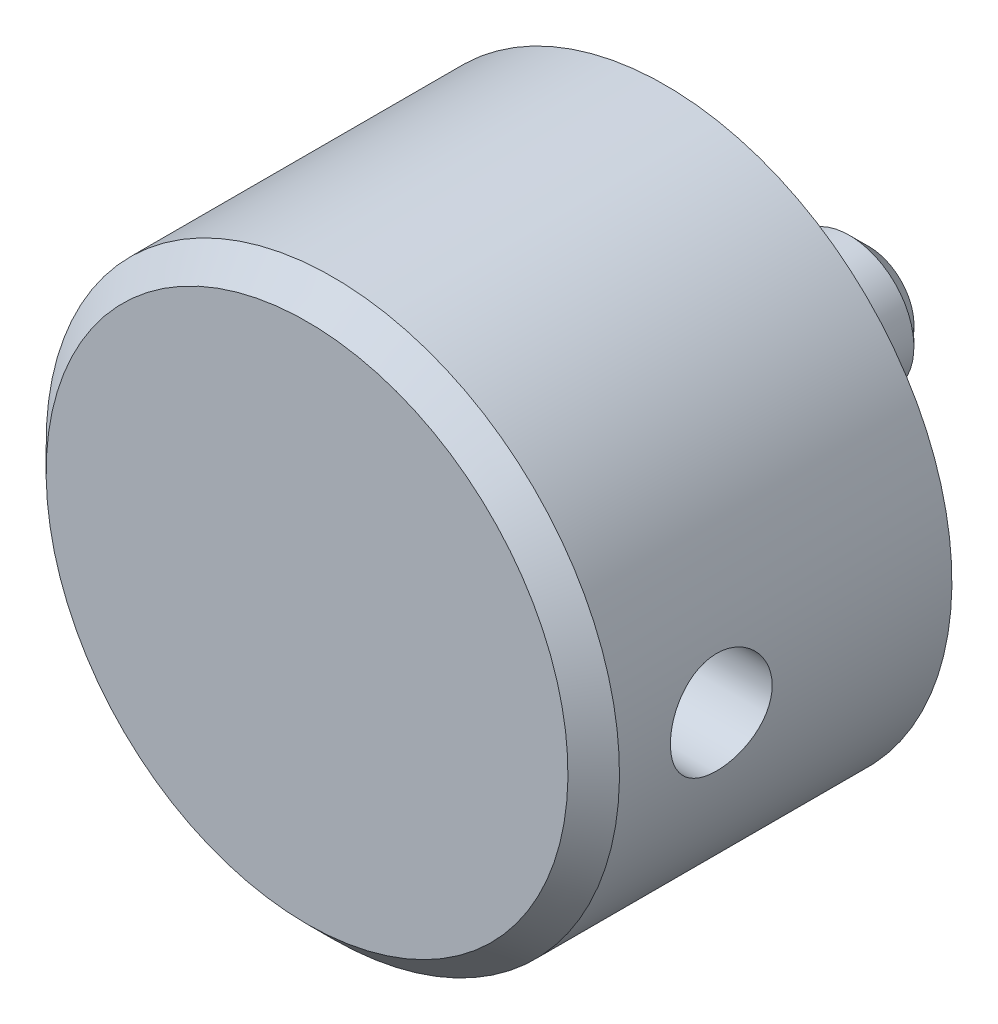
ISO-10303-21;
HEADER;
FILE_DESCRIPTION(('STEP AP214'),'2;1');
FILE_NAME('part.step','',(''),(''),'','','');
FILE_SCHEMA(('AUTOMOTIVE_DESIGN { 1 0 10303 214 1 1 1 1 }'));
ENDSEC;
DATA;
#1=APPLICATION_CONTEXT('core data for automotive mechanical design processes');
#2=APPLICATION_PROTOCOL_DEFINITION('international standard','automotive_design',2000,#1);
#3=PRODUCT_CONTEXT('',#1,'mechanical');
#4=PRODUCT('Part','Part','',(#3));
#5=PRODUCT_RELATED_PRODUCT_CATEGORY('part','',(#4));
#6=PRODUCT_DEFINITION_FORMATION('','',#4);
#7=PRODUCT_DEFINITION_CONTEXT('part definition',#1,'design');
#8=PRODUCT_DEFINITION('design','',#6,#7);
#9=PRODUCT_DEFINITION_SHAPE('','',#8);
#10=(LENGTH_UNIT() NAMED_UNIT(*) SI_UNIT(.MILLI.,.METRE.));
#11=(NAMED_UNIT(*) PLANE_ANGLE_UNIT() SI_UNIT($,.RADIAN.));
#12=(NAMED_UNIT(*) SI_UNIT($,.STERADIAN.) SOLID_ANGLE_UNIT());
#13=UNCERTAINTY_MEASURE_WITH_UNIT(LENGTH_MEASURE(1.E-05),#10,'distance_accuracy_value','');
#14=(GEOMETRIC_REPRESENTATION_CONTEXT(3) GLOBAL_UNCERTAINTY_ASSIGNED_CONTEXT((#13)) GLOBAL_UNIT_ASSIGNED_CONTEXT((#10,
#11,#12)) REPRESENTATION_CONTEXT('',''));
#15=CARTESIAN_POINT('',(0.,0.,0.));
#16=DIRECTION('',(0.,0.,1.));
#17=DIRECTION('',(1.,0.,0.));
#18=AXIS2_PLACEMENT_3D('',#15,#16,#17);
#19=CARTESIAN_POINT('',(0.,0.,29.));
#20=DIRECTION('',(0.,0.,1.));
#21=DIRECTION('',(0.,-1.,0.));
#22=AXIS2_PLACEMENT_3D('',#19,#20,#21);
#23=PLANE('',#22);
#24=CARTESIAN_POINT('',(0.,0.,29.));
#25=DIRECTION('',(0.,0.,1.));
#26=DIRECTION('',(0.,-1.,0.));
#27=AXIS2_PLACEMENT_3D('',#24,#25,#26);
#28=CIRCLE('',#27,20.25);
#29=CARTESIAN_POINT('',(0.,-20.25,29.));
#30=VERTEX_POINT('',#29);
#31=EDGE_CURVE('E86',#30,#30,#28,.T.);
#32=ORIENTED_EDGE('',*,*,#31,.T.);
#33=EDGE_LOOP('',(#32));
#34=FACE_BOUND('',#33,.T.);
#35=ADVANCED_FACE('F12',(#34),#23,.T.);
#36=CARTESIAN_POINT('',(0.,0.,39.1));
#37=DIRECTION('',(0.,0.,1.));
#38=DIRECTION('',(0.,-1.,0.));
#39=AXIS2_PLACEMENT_3D('',#36,#37,#38);
#40=CYLINDRICAL_SURFACE('',#39,22.25);
#41=CARTESIAN_POINT('',(0.,0.,27.));
#42=DIRECTION('',(0.,0.,1.));
#43=DIRECTION('',(0.,-1.,0.));
#44=AXIS2_PLACEMENT_3D('',#41,#42,#43);
#45=CIRCLE('',#44,22.25);
#46=CARTESIAN_POINT('',(0.,-22.25,27.));
#47=VERTEX_POINT('',#46);
#48=EDGE_CURVE('E87',#47,#47,#45,.F.);
#49=ORIENTED_EDGE('',*,*,#48,.T.);
#50=EDGE_LOOP('',(#49));
#51=FACE_BOUND('',#50,.T.);
#52=CARTESIAN_POINT('',(-22.25,0.,15.15));
#53=CARTESIAN_POINT('',(-22.2499961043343,-0.220020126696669,15.1500086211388));
#54=CARTESIAN_POINT('',(-22.2467026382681,-0.440154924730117,15.16844522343));
#55=CARTESIAN_POINT('',(-22.2338816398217,-0.874235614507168,15.2416653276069));
#56=CARTESIAN_POINT('',(-22.2243486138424,-1.08817587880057,15.2964808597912));
#57=CARTESIAN_POINT('',(-22.2001162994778,-1.50352571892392,15.4407393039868));
#58=CARTESIAN_POINT('',(-22.185421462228,-1.70494591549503,15.5301523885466));
#59=CARTESIAN_POINT('',(-22.1524756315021,-2.08990339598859,15.7409863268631));
#60=CARTESIAN_POINT('',(-22.1342249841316,-2.27344241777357,15.8624040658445));
#61=CARTESIAN_POINT('',(-22.095966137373,-2.61942964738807,16.1351925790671));
#62=CARTESIAN_POINT('',(-22.075942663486,-2.7816569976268,16.2868413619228));
#63=CARTESIAN_POINT('',(-22.0365100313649,-3.07850659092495,16.6151889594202));
#64=CARTESIAN_POINT('',(-22.0171009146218,-3.21312697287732,16.7918894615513));
#65=CARTESIAN_POINT('',(-21.9809464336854,-3.45184347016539,17.1668641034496));
#66=CARTESIAN_POINT('',(-21.964220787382,-3.55571798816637,17.3652813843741));
#67=CARTESIAN_POINT('',(-21.9355406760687,-3.72857631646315,17.7770959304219));
#68=CARTESIAN_POINT('',(-21.9235858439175,-3.79756281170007,17.9904920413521));
#69=CARTESIAN_POINT('',(-21.905953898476,-3.89798432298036,18.4238540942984));
#70=CARTESIAN_POINT('',(-21.9002127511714,-3.92980264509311,18.6437285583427));
#71=CARTESIAN_POINT('',(-21.8954648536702,-3.95617372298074,19.0857645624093));
#72=CARTESIAN_POINT('',(-21.8964575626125,-3.95072947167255,19.3079259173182));
#73=CARTESIAN_POINT('',(-21.9050068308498,-3.90304144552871,19.7454725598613));
#74=CARTESIAN_POINT('',(-21.9124861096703,-3.86123091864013,19.9609067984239));
#75=CARTESIAN_POINT('',(-21.9330446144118,-3.7426783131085,20.3816534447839));
#76=CARTESIAN_POINT('',(-21.9461240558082,-3.66593489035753,20.5869654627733));
#77=CARTESIAN_POINT('',(-21.9764912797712,-3.47926362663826,20.9829217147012));
#78=CARTESIAN_POINT('',(-21.9938014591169,-3.36915840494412,21.1734805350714));
#79=CARTESIAN_POINT('',(-22.0306645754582,-3.11901471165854,21.5335816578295));
#80=CARTESIAN_POINT('',(-22.0502177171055,-2.97897350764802,21.7031220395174));
#81=CARTESIAN_POINT('',(-22.0897017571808,-2.67058505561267,22.0188791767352));
#82=CARTESIAN_POINT('',(-22.1096340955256,-2.50186666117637,22.1647335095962));
#83=CARTESIAN_POINT('',(-22.1473766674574,-2.14216158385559,22.4261194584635));
#84=CARTESIAN_POINT('',(-22.1651868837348,-1.95117471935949,22.5416508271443));
#85=CARTESIAN_POINT('',(-22.1967089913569,-1.55199446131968,22.7391546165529));
#86=CARTESIAN_POINT('',(-22.2104166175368,-1.34378344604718,22.821092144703));
#87=CARTESIAN_POINT('',(-22.2321555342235,-0.916256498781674,22.9487308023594));
#88=CARTESIAN_POINT('',(-22.240187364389,-0.696941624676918,22.9944353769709));
#89=CARTESIAN_POINT('',(-22.2495963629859,-0.256553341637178,23.047812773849));
#90=CARTESIAN_POINT('',(-22.2510604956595,-0.0355419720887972,23.0559826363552));
#91=CARTESIAN_POINT('',(-22.2474083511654,0.404690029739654,23.0353879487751));
#92=CARTESIAN_POINT('',(-22.2422923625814,0.623910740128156,23.0066250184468));
#93=CARTESIAN_POINT('',(-22.226108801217,1.05278233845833,22.9133945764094));
#94=CARTESIAN_POINT('',(-22.2150827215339,1.26248902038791,22.8491758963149));
#95=CARTESIAN_POINT('',(-22.1883101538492,1.66815957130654,22.6871241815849));
#96=CARTESIAN_POINT('',(-22.1725633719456,1.86412258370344,22.5892890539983));
#97=CARTESIAN_POINT('',(-22.1378795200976,2.23888302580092,22.3616627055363));
#98=CARTESIAN_POINT('',(-22.1189123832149,2.41749111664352,22.2315644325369));
#99=CARTESIAN_POINT('',(-22.0799753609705,2.7505183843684,21.9435236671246));
#100=CARTESIAN_POINT('',(-22.0600053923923,2.90493554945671,21.7855788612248));
#101=CARTESIAN_POINT('',(-22.0210285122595,3.18706362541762,21.4440883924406));
#102=CARTESIAN_POINT('',(-22.0020357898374,3.31443696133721,21.260261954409));
#103=CARTESIAN_POINT('',(-21.9674390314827,3.53649611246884,20.8735296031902));
#104=CARTESIAN_POINT('',(-21.9518348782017,3.63118305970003,20.6706243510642));
#105=CARTESIAN_POINT('',(-21.9258909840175,3.78468997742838,20.2523938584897));
#106=CARTESIAN_POINT('',(-21.9155276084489,3.84367121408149,20.0371293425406));
#107=CARTESIAN_POINT('',(-21.9011819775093,3.924595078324,19.5995469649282));
#108=CARTESIAN_POINT('',(-21.8971990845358,3.94654140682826,19.3772298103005));
#109=CARTESIAN_POINT('',(-21.8960953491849,3.95265873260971,18.9352289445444));
#110=CARTESIAN_POINT('',(-21.8988778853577,3.9373616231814,18.715552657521));
#111=CARTESIAN_POINT('',(-21.9107784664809,3.87058371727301,18.2819542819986));
#112=CARTESIAN_POINT('',(-21.9198964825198,3.8191030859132,18.0680321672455));
#113=CARTESIAN_POINT('',(-21.943401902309,3.68163387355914,17.6522611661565));
#114=CARTESIAN_POINT('',(-21.9577813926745,3.59569709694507,17.4503946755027));
#115=CARTESIAN_POINT('',(-21.9901961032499,3.391811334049,17.0638590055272));
#116=CARTESIAN_POINT('',(-22.008231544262,3.27386041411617,16.8791908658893));
#117=CARTESIAN_POINT('',(-22.0462291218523,3.00742108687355,16.5296181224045));
#118=CARTESIAN_POINT('',(-22.0662139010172,2.85854345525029,16.3650125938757));
#119=CARTESIAN_POINT('',(-22.1056835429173,2.53529341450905,16.0629406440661));
#120=CARTESIAN_POINT('',(-22.1251682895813,2.36091514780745,15.9254804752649));
#121=CARTESIAN_POINT('',(-22.1616231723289,1.98995874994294,15.6805905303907));
#122=CARTESIAN_POINT('',(-22.1785720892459,1.79321517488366,15.5734081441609));
#123=CARTESIAN_POINT('',(-22.2078390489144,1.38428488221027,15.3937851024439));
#124=CARTESIAN_POINT('',(-22.2201615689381,1.1721133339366,15.321310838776));
#125=CARTESIAN_POINT('',(-22.2361874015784,0.799346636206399,15.2283799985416));
#126=CARTESIAN_POINT('',(-22.2413386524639,0.640969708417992,15.1990361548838));
#127=CARTESIAN_POINT('',(-22.2482463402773,0.321748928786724,15.1598432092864));
#128=CARTESIAN_POINT('',(-22.2500028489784,0.160905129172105,15.1499936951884));
#129=CARTESIAN_POINT('',(-22.25,0.,15.15));
#130=B_SPLINE_CURVE_WITH_KNOTS('',3,(#52,#53,#54,#55,#56,#57,#58,#59,#60,#61,#62,#63,#64,#65,
#66,#67,#68,#69,#70,#71,#72,#73,#74,#75,#76,#77,#78,#79,#80,#81,#82,#83,#84,#85,#86,#87,#88,#89,
#90,#91,#92,#93,#94,#95,#96,#97,#98,#99,#100,#101,#102,#103,#104,#105,#106,#107,#108,#109,#110,
#111,#112,#113,#114,#115,#116,#117,#118,#119,#120,#121,#122,#123,#124,#125,#126,#127,#128,#129),
.UNSPECIFIED.,.T.,.F.,(4,2,2,2,2,2,2,2,2,2,2,2,2,2,2,2,2,2,2,2,2,2,2,2,2,2,2,2,2,2,2,2,2,2,2,2,
2,2,4),(0.,0.659472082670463,1.31952557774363,1.9790112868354,2.63843283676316,3.30422421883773,
3.97006047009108,4.64058491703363,5.31105775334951,5.97455336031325,6.63799567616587,
7.29364071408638,7.94931098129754,8.6085304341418,9.26781008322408,9.93638213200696,
10.6049596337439,11.2742298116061,11.9434363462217,12.6037551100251,13.2640449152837,
13.9197585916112,14.5755130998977,15.2377655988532,15.9000731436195,16.5702164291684,
17.2403365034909,17.9074069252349,18.5744106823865,19.2319446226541,19.8894755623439,
20.5460215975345,21.2026072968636,21.8680200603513,22.5335859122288,23.2044421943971,
23.8746475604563,24.3569429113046,24.839228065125),.UNSPECIFIED.);
#131=CARTESIAN_POINT('',(-22.25,0.,15.15));
#132=VERTEX_POINT('',#131);
#133=EDGE_CURVE('E24',#132,#132,#130,.T.);
#134=ORIENTED_EDGE('',*,*,#133,.F.);
#135=EDGE_LOOP('',(#134));
#136=FACE_BOUND('',#135,.T.);
#137=CARTESIAN_POINT('',(22.25,0.,15.15));
#138=CARTESIAN_POINT('',(22.2499961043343,0.220020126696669,15.1500086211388));
#139=CARTESIAN_POINT('',(22.2467026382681,0.440154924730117,15.16844522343));
#140=CARTESIAN_POINT('',(22.2338816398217,0.874235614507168,15.2416653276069));
#141=CARTESIAN_POINT('',(22.2243486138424,1.08817587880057,15.2964808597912));
#142=CARTESIAN_POINT('',(22.2001162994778,1.50352571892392,15.4407393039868));
#143=CARTESIAN_POINT('',(22.185421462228,1.70494591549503,15.5301523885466));
#144=CARTESIAN_POINT('',(22.1524756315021,2.08990339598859,15.7409863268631));
#145=CARTESIAN_POINT('',(22.1342249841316,2.27344241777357,15.8624040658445));
#146=CARTESIAN_POINT('',(22.095966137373,2.61942964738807,16.1351925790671));
#147=CARTESIAN_POINT('',(22.075942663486,2.7816569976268,16.2868413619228));
#148=CARTESIAN_POINT('',(22.0365100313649,3.07850659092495,16.6151889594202));
#149=CARTESIAN_POINT('',(22.0171009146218,3.21312697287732,16.7918894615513));
#150=CARTESIAN_POINT('',(21.9809464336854,3.45184347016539,17.1668641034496));
#151=CARTESIAN_POINT('',(21.964220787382,3.55571798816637,17.3652813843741));
#152=CARTESIAN_POINT('',(21.9355406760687,3.72857631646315,17.7770959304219));
#153=CARTESIAN_POINT('',(21.9235858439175,3.79756281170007,17.9904920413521));
#154=CARTESIAN_POINT('',(21.905953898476,3.89798432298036,18.4238540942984));
#155=CARTESIAN_POINT('',(21.9002127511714,3.92980264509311,18.6437285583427));
#156=CARTESIAN_POINT('',(21.8954648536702,3.95617372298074,19.0857645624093));
#157=CARTESIAN_POINT('',(21.8964575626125,3.95072947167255,19.3079259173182));
#158=CARTESIAN_POINT('',(21.9050068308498,3.90304144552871,19.7454725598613));
#159=CARTESIAN_POINT('',(21.9124861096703,3.86123091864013,19.9609067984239));
#160=CARTESIAN_POINT('',(21.9330446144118,3.7426783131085,20.3816534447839));
#161=CARTESIAN_POINT('',(21.9461240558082,3.66593489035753,20.5869654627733));
#162=CARTESIAN_POINT('',(21.9764912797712,3.47926362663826,20.9829217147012));
#163=CARTESIAN_POINT('',(21.9938014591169,3.36915840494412,21.1734805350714));
#164=CARTESIAN_POINT('',(22.0306645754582,3.11901471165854,21.5335816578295));
#165=CARTESIAN_POINT('',(22.0502177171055,2.97897350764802,21.7031220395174));
#166=CARTESIAN_POINT('',(22.0897017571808,2.67058505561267,22.0188791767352));
#167=CARTESIAN_POINT('',(22.1096340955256,2.50186666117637,22.1647335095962));
#168=CARTESIAN_POINT('',(22.1473766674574,2.14216158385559,22.4261194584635));
#169=CARTESIAN_POINT('',(22.1651868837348,1.95117471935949,22.5416508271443));
#170=CARTESIAN_POINT('',(22.1967089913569,1.55199446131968,22.7391546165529));
#171=CARTESIAN_POINT('',(22.2104166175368,1.34378344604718,22.821092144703));
#172=CARTESIAN_POINT('',(22.2321555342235,0.916256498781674,22.9487308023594));
#173=CARTESIAN_POINT('',(22.240187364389,0.696941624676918,22.9944353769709));
#174=CARTESIAN_POINT('',(22.2495963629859,0.256553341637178,23.047812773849));
#175=CARTESIAN_POINT('',(22.2510604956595,0.0355419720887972,23.0559826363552));
#176=CARTESIAN_POINT('',(22.2474083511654,-0.404690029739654,23.0353879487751));
#177=CARTESIAN_POINT('',(22.2422923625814,-0.623910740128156,23.0066250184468));
#178=CARTESIAN_POINT('',(22.226108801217,-1.05278233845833,22.9133945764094));
#179=CARTESIAN_POINT('',(22.2150827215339,-1.26248902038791,22.8491758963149));
#180=CARTESIAN_POINT('',(22.1883101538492,-1.66815957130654,22.6871241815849));
#181=CARTESIAN_POINT('',(22.1725633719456,-1.86412258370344,22.5892890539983));
#182=CARTESIAN_POINT('',(22.1378795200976,-2.23888302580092,22.3616627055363));
#183=CARTESIAN_POINT('',(22.1189123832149,-2.41749111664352,22.2315644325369));
#184=CARTESIAN_POINT('',(22.0799753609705,-2.7505183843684,21.9435236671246));
#185=CARTESIAN_POINT('',(22.0600053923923,-2.90493554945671,21.7855788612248));
#186=CARTESIAN_POINT('',(22.0210285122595,-3.18706362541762,21.4440883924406));
#187=CARTESIAN_POINT('',(22.0020357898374,-3.31443696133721,21.260261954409));
#188=CARTESIAN_POINT('',(21.9674390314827,-3.53649611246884,20.8735296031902));
#189=CARTESIAN_POINT('',(21.9518348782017,-3.63118305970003,20.6706243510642));
#190=CARTESIAN_POINT('',(21.9258909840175,-3.78468997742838,20.2523938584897));
#191=CARTESIAN_POINT('',(21.9155276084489,-3.84367121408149,20.0371293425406));
#192=CARTESIAN_POINT('',(21.9011819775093,-3.924595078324,19.5995469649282));
#193=CARTESIAN_POINT('',(21.8971990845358,-3.94654140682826,19.3772298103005));
#194=CARTESIAN_POINT('',(21.8960953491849,-3.95265873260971,18.9352289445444));
#195=CARTESIAN_POINT('',(21.8988778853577,-3.9373616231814,18.715552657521));
#196=CARTESIAN_POINT('',(21.9107784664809,-3.87058371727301,18.2819542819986));
#197=CARTESIAN_POINT('',(21.9198964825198,-3.8191030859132,18.0680321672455));
#198=CARTESIAN_POINT('',(21.943401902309,-3.68163387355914,17.6522611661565));
#199=CARTESIAN_POINT('',(21.9577813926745,-3.59569709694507,17.4503946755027));
#200=CARTESIAN_POINT('',(21.9901961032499,-3.391811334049,17.0638590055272));
#201=CARTESIAN_POINT('',(22.008231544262,-3.27386041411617,16.8791908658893));
#202=CARTESIAN_POINT('',(22.0462291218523,-3.00742108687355,16.5296181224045));
#203=CARTESIAN_POINT('',(22.0662139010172,-2.85854345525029,16.3650125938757));
#204=CARTESIAN_POINT('',(22.1056835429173,-2.53529341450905,16.0629406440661));
#205=CARTESIAN_POINT('',(22.1251682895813,-2.36091514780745,15.9254804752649));
#206=CARTESIAN_POINT('',(22.1616231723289,-1.98995874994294,15.6805905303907));
#207=CARTESIAN_POINT('',(22.1785720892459,-1.79321517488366,15.5734081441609));
#208=CARTESIAN_POINT('',(22.2078390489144,-1.38428488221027,15.3937851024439));
#209=CARTESIAN_POINT('',(22.2201615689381,-1.1721133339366,15.321310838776));
#210=CARTESIAN_POINT('',(22.2361874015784,-0.799346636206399,15.2283799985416));
#211=CARTESIAN_POINT('',(22.2413386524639,-0.640969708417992,15.1990361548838));
#212=CARTESIAN_POINT('',(22.2482463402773,-0.321748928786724,15.1598432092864));
#213=CARTESIAN_POINT('',(22.2500028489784,-0.160905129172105,15.1499936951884));
#214=CARTESIAN_POINT('',(22.25,0.,15.15));
#215=B_SPLINE_CURVE_WITH_KNOTS('',3,(#137,#138,#139,#140,#141,#142,#143,#144,#145,#146,#147,
#148,#149,#150,#151,#152,#153,#154,#155,#156,#157,#158,#159,#160,#161,#162,#163,#164,#165,#166,
#167,#168,#169,#170,#171,#172,#173,#174,#175,#176,#177,#178,#179,#180,#181,#182,#183,#184,#185,
#186,#187,#188,#189,#190,#191,#192,#193,#194,#195,#196,#197,#198,#199,#200,#201,#202,#203,#204,
#205,#206,#207,#208,#209,#210,#211,#212,#213,#214),.UNSPECIFIED.,.T.,.F.,(4,2,2,2,2,2,2,2,2,2,2,
2,2,2,2,2,2,2,2,2,2,2,2,2,2,2,2,2,2,2,2,2,2,2,2,2,2,2,4),(0.,0.659472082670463,1.31952557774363,
1.9790112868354,2.63843283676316,3.30422421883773,3.97006047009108,4.64058491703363,
5.31105775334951,5.97455336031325,6.63799567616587,7.29364071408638,7.94931098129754,
8.6085304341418,9.26781008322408,9.93638213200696,10.6049596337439,11.2742298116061,
11.9434363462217,12.6037551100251,13.2640449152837,13.9197585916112,14.5755130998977,
15.2377655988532,15.9000731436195,16.5702164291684,17.2403365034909,17.9074069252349,
18.5744106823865,19.2319446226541,19.8894755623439,20.5460215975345,21.2026072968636,
21.8680200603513,22.5335859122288,23.2044421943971,23.8746475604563,24.3569429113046,
24.839228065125),.UNSPECIFIED.);
#216=CARTESIAN_POINT('',(22.25,0.,15.15));
#217=VERTEX_POINT('',#216);
#218=EDGE_CURVE('E8',#217,#217,#215,.T.);
#219=ORIENTED_EDGE('',*,*,#218,.F.);
#220=EDGE_LOOP('',(#219));
#221=FACE_BOUND('',#220,.T.);
#222=CARTESIAN_POINT('',(0.,0.,1.2));
#223=DIRECTION('',(0.,0.,1.));
#224=DIRECTION('',(0.,-1.,0.));
#225=AXIS2_PLACEMENT_3D('',#222,#223,#224);
#226=CIRCLE('',#225,22.25);
#227=CARTESIAN_POINT('',(0.,-22.25,1.2));
#228=VERTEX_POINT('',#227);
#229=EDGE_CURVE('E90',#228,#228,#226,.T.);
#230=ORIENTED_EDGE('',*,*,#229,.T.);
#231=EDGE_LOOP('',(#230));
#232=FACE_BOUND('',#231,.T.);
#233=ADVANCED_FACE('F40',(#51,#136,#221,#232),#40,.T.);
#234=CARTESIAN_POINT('',(0.,22.25,1.2));
#235=DIRECTION('',(0.,0.,-1.));
#236=DIRECTION('',(0.,1.,0.));
#237=AXIS2_PLACEMENT_3D('',#234,#235,#236);
#238=PLANE('',#237);
#239=CARTESIAN_POINT('',(0.,0.,1.2));
#240=DIRECTION('',(0.,0.,1.));
#241=DIRECTION('',(0.,-1.,0.));
#242=AXIS2_PLACEMENT_3D('',#239,#240,#241);
#243=CIRCLE('',#242,9.55);
#244=CARTESIAN_POINT('',(0.,-9.55,1.2));
#245=VERTEX_POINT('',#244);
#246=EDGE_CURVE('E96',#245,#245,#243,.T.);
#247=ORIENTED_EDGE('',*,*,#246,.T.);
#248=EDGE_LOOP('',(#247));
#249=FACE_BOUND('',#248,.T.);
#250=ORIENTED_EDGE('',*,*,#229,.F.);
#251=EDGE_LOOP('',(#250));
#252=FACE_BOUND('',#251,.T.);
#253=ADVANCED_FACE('F45',(#249,#252),#238,.T.);
#254=CARTESIAN_POINT('',(0.,0.,39.1));
#255=DIRECTION('',(0.,0.,1.));
#256=DIRECTION('',(0.,-1.,0.));
#257=AXIS2_PLACEMENT_3D('',#254,#255,#256);
#258=CYLINDRICAL_SURFACE('',#257,9.55);
#259=CARTESIAN_POINT('',(0.,0.,0.));
#260=DIRECTION('',(0.,0.,1.));
#261=DIRECTION('',(0.,-1.,0.));
#262=AXIS2_PLACEMENT_3D('',#259,#260,#261);
#263=CIRCLE('',#262,9.55);
#264=CARTESIAN_POINT('',(0.,-9.55,0.));
#265=VERTEX_POINT('',#264);
#266=EDGE_CURVE('E98',#265,#265,#263,.T.);
#267=ORIENTED_EDGE('',*,*,#266,.T.);
#268=EDGE_LOOP('',(#267));
#269=FACE_BOUND('',#268,.T.);
#270=ORIENTED_EDGE('',*,*,#246,.F.);
#271=EDGE_LOOP('',(#270));
#272=FACE_BOUND('',#271,.T.);
#273=ADVANCED_FACE('F51',(#269,#272),#258,.T.);
#274=CARTESIAN_POINT('',(0.,9.55,0.));
#275=DIRECTION('',(0.,0.,-1.));
#276=DIRECTION('',(0.,1.,0.));
#277=AXIS2_PLACEMENT_3D('',#274,#275,#276);
#278=PLANE('',#277);
#279=CARTESIAN_POINT('',(0.,0.,0.));
#280=DIRECTION('',(0.,0.,1.));
#281=DIRECTION('',(0.,-1.,0.));
#282=AXIS2_PLACEMENT_3D('',#279,#280,#281);
#283=CIRCLE('',#282,5.);
#284=CARTESIAN_POINT('',(0.,-5.,0.));
#285=VERTEX_POINT('',#284);
#286=EDGE_CURVE('E38',#285,#285,#283,.T.);
#287=ORIENTED_EDGE('',*,*,#286,.T.);
#288=EDGE_LOOP('',(#287));
#289=FACE_BOUND('',#288,.T.);
#290=ORIENTED_EDGE('',*,*,#266,.F.);
#291=EDGE_LOOP('',(#290));
#292=FACE_BOUND('',#291,.T.);
#293=ADVANCED_FACE('F55',(#289,#292),#278,.T.);
#294=CARTESIAN_POINT('',(0.,0.,39.1));
#295=DIRECTION('',(0.,0.,1.));
#296=DIRECTION('',(0.,-1.,0.));
#297=AXIS2_PLACEMENT_3D('',#294,#295,#296);
#298=CYLINDRICAL_SURFACE('',#297,5.);
#299=CARTESIAN_POINT('',(0.,0.,-13.1));
#300=DIRECTION('',(0.,0.,-1.));
#301=DIRECTION('',(-1.,0.,0.));
#302=AXIS2_PLACEMENT_3D('',#299,#300,#301);
#303=CIRCLE('',#302,5.);
#304=CARTESIAN_POINT('',(-5.,0.,-13.1));
#305=VERTEX_POINT('',#304);
#306=EDGE_CURVE('E32',#305,#305,#303,.F.);
#307=ORIENTED_EDGE('',*,*,#306,.T.);
#308=EDGE_LOOP('',(#307));
#309=FACE_BOUND('',#308,.T.);
#310=ORIENTED_EDGE('',*,*,#286,.F.);
#311=EDGE_LOOP('',(#310));
#312=FACE_BOUND('',#311,.T.);
#313=ADVANCED_FACE('F59',(#309,#312),#298,.T.);
#314=CARTESIAN_POINT('',(0.,5.,-14.6));
#315=DIRECTION('',(0.,0.,-1.));
#316=DIRECTION('',(0.,1.,0.));
#317=AXIS2_PLACEMENT_3D('',#314,#315,#316);
#318=PLANE('',#317);
#319=CARTESIAN_POINT('',(0.,0.,-14.6));
#320=DIRECTION('',(0.,0.,-1.));
#321=DIRECTION('',(-1.,0.,0.));
#322=AXIS2_PLACEMENT_3D('',#319,#320,#321);
#323=CIRCLE('',#322,3.5);
#324=CARTESIAN_POINT('',(-3.5,0.,-14.6));
#325=VERTEX_POINT('',#324);
#326=EDGE_CURVE('E28',#325,#325,#323,.T.);
#327=ORIENTED_EDGE('',*,*,#326,.T.);
#328=EDGE_LOOP('',(#327));
#329=FACE_BOUND('',#328,.T.);
#330=ADVANCED_FACE('F63',(#329),#318,.T.);
#331=CARTESIAN_POINT('',(0.,0.,29.));
#332=DIRECTION('',(0.,0.,-1.));
#333=DIRECTION('',(0.,1.,0.));
#334=AXIS2_PLACEMENT_3D('',#331,#332,#333);
#335=CONICAL_SURFACE('',#334,20.25,0.785398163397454);
#336=ORIENTED_EDGE('',*,*,#48,.F.);
#337=EDGE_LOOP('',(#336));
#338=FACE_BOUND('',#337,.T.);
#339=ORIENTED_EDGE('',*,*,#31,.F.);
#340=EDGE_LOOP('',(#339));
#341=FACE_BOUND('',#340,.T.);
#342=ADVANCED_FACE('F66',(#338,#341),#335,.T.);
#343=CARTESIAN_POINT('',(0.,0.,-13.1));
#344=DIRECTION('',(0.,0.,1.));
#345=DIRECTION('',(1.,0.,0.));
#346=AXIS2_PLACEMENT_3D('',#343,#344,#345);
#347=CONICAL_SURFACE('',#346,5.,0.785398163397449);
#348=ORIENTED_EDGE('',*,*,#326,.F.);
#349=EDGE_LOOP('',(#348));
#350=FACE_BOUND('',#349,.T.);
#351=ORIENTED_EDGE('',*,*,#306,.F.);
#352=EDGE_LOOP('',(#351));
#353=FACE_BOUND('',#352,.T.);
#354=ADVANCED_FACE('F69',(#350,#353),#347,.T.);
#355=CARTESIAN_POINT('',(-32.2687242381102,0.,19.1));
#356=DIRECTION('',(1.,0.,0.));
#357=DIRECTION('',(0.,0.,-1.));
#358=AXIS2_PLACEMENT_3D('',#355,#356,#357);
#359=CYLINDRICAL_SURFACE('',#358,3.95);
#360=ORIENTED_EDGE('',*,*,#133,.T.);
#361=EDGE_LOOP('',(#360));
#362=FACE_BOUND('',#361,.T.);
#363=ORIENTED_EDGE('',*,*,#218,.T.);
#364=EDGE_LOOP('',(#363));
#365=FACE_BOUND('',#364,.T.);
#366=ADVANCED_FACE('F14',(#362,#365),#359,.F.);
#367=CLOSED_SHELL('',(#35,#233,#253,#273,#293,#313,#330,#342,#354,#366));
#368=MANIFOLD_SOLID_BREP('B1',#367);
#369=ADVANCED_BREP_SHAPE_REPRESENTATION('',(#18,#368),#14);
#370=SHAPE_DEFINITION_REPRESENTATION(#9,#369);
ENDSEC;
END-ISO-10303-21;
